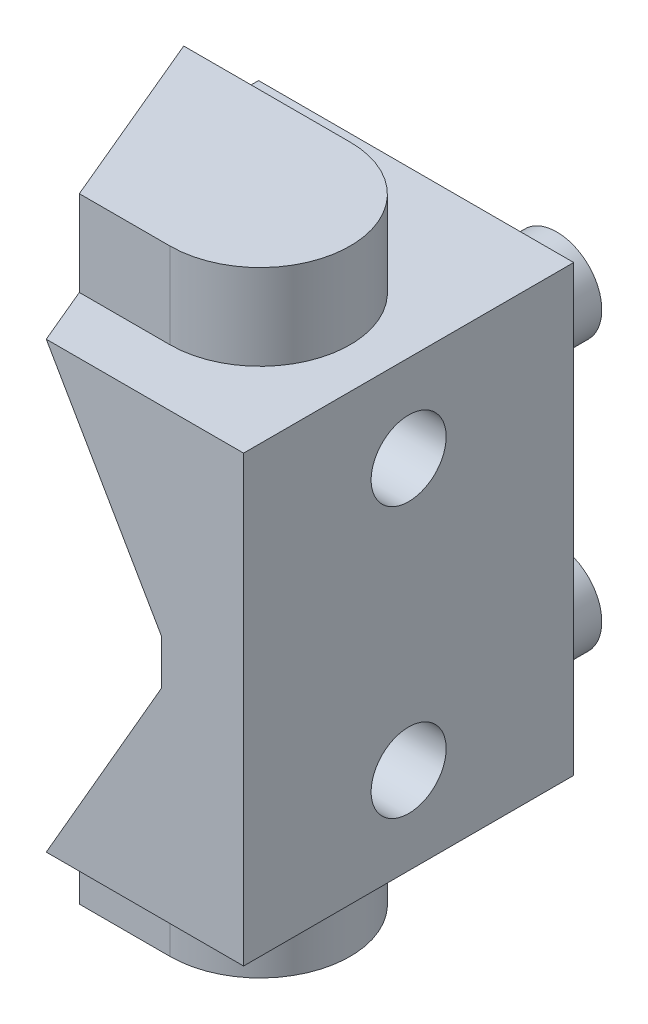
ISO-10303-21;
HEADER;
FILE_DESCRIPTION(('STEP AP214'),'2;1');
FILE_NAME('part.step','',(''),(''),'','','');
FILE_SCHEMA(('AUTOMOTIVE_DESIGN { 1 0 10303 214 1 1 1 1 }'));
ENDSEC;
DATA;
#1=APPLICATION_CONTEXT('core data for automotive mechanical design processes');
#2=APPLICATION_PROTOCOL_DEFINITION('international standard','automotive_design',2000,#1);
#3=PRODUCT_CONTEXT('',#1,'mechanical');
#4=PRODUCT('Part','Part','',(#3));
#5=PRODUCT_RELATED_PRODUCT_CATEGORY('part','',(#4));
#6=PRODUCT_DEFINITION_FORMATION('','',#4);
#7=PRODUCT_DEFINITION_CONTEXT('part definition',#1,'design');
#8=PRODUCT_DEFINITION('design','',#6,#7);
#9=PRODUCT_DEFINITION_SHAPE('','',#8);
#10=(LENGTH_UNIT() NAMED_UNIT(*) SI_UNIT(.MILLI.,.METRE.));
#11=(NAMED_UNIT(*) PLANE_ANGLE_UNIT() SI_UNIT($,.RADIAN.));
#12=(NAMED_UNIT(*) SI_UNIT($,.STERADIAN.) SOLID_ANGLE_UNIT());
#13=UNCERTAINTY_MEASURE_WITH_UNIT(LENGTH_MEASURE(1.E-05),#10,'distance_accuracy_value','');
#14=(GEOMETRIC_REPRESENTATION_CONTEXT(3) GLOBAL_UNCERTAINTY_ASSIGNED_CONTEXT((#13)) GLOBAL_UNIT_ASSIGNED_CONTEXT((#10,
#11,#12)) REPRESENTATION_CONTEXT('',''));
#15=CARTESIAN_POINT('',(0.,0.,0.));
#16=DIRECTION('',(0.,0.,1.));
#17=DIRECTION('',(1.,0.,0.));
#18=AXIS2_PLACEMENT_3D('',#15,#16,#17);
#19=CARTESIAN_POINT('',(-10.7228679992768,0.,0.));
#20=DIRECTION('',(0.,0.,-1.));
#21=DIRECTION('',(-1.,0.,0.));
#22=AXIS2_PLACEMENT_3D('',#19,#20,#21);
#23=PLANE('',#22);
#24=CARTESIAN_POINT('',(-5.12842325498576,9.,0.));
#25=DIRECTION('',(0.,0.,-1.));
#26=DIRECTION('',(-1.,0.,0.));
#27=AXIS2_PLACEMENT_3D('',#24,#25,#26);
#28=CIRCLE('',#27,3.);
#29=CARTESIAN_POINT('',(-8.12842325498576,9.,0.));
#30=VERTEX_POINT('',#29);
#31=EDGE_CURVE('E407',#30,#30,#28,.T.);
#32=ORIENTED_EDGE('',*,*,#31,.F.);
#33=EDGE_LOOP('',(#32));
#34=FACE_BOUND('',#33,.T.);
#35=DIRECTION('',(0.,-1.,0.));
#36=VECTOR('',#35,1.);
#37=CARTESIAN_POINT('',(0.,-14.8,0.));
#38=LINE('',#37,#36);
#39=CARTESIAN_POINT('',(0.,14.8,0.));
#40=VERTEX_POINT('',#39);
#41=CARTESIAN_POINT('',(0.,-14.8,0.));
#42=VERTEX_POINT('',#41);
#43=EDGE_CURVE('E129',#40,#42,#38,.T.);
#44=ORIENTED_EDGE('',*,*,#43,.T.);
#45=DIRECTION('',(-1.,0.,0.));
#46=VECTOR('',#45,1.);
#47=CARTESIAN_POINT('',(-10.7228679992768,-14.8,0.));
#48=LINE('',#47,#46);
#49=CARTESIAN_POINT('',(-21.,-14.8,0.));
#50=VERTEX_POINT('',#49);
#51=EDGE_CURVE('E138',#42,#50,#48,.T.);
#52=ORIENTED_EDGE('',*,*,#51,.T.);
#53=DIRECTION('',(0.,1.,0.));
#54=VECTOR('',#53,1.);
#55=CARTESIAN_POINT('',(-21.,0.,0.));
#56=LINE('',#55,#54);
#57=CARTESIAN_POINT('',(-21.,-12.3843031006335,0.));
#58=VERTEX_POINT('',#57);
#59=EDGE_CURVE('E148',#50,#58,#56,.T.);
#60=ORIENTED_EDGE('',*,*,#59,.T.);
#61=DIRECTION('',(0.5,0.866025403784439,0.));
#62=VECTOR('',#61,1.);
#63=CARTESIAN_POINT('',(-21.,-12.3843031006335,0.));
#64=LINE('',#63,#62);
#65=CARTESIAN_POINT('',(-14.7159277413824,-1.49997067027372,0.));
#66=VERTEX_POINT('',#65);
#67=EDGE_CURVE('E151',#58,#66,#64,.T.);
#68=ORIENTED_EDGE('',*,*,#67,.T.);
#69=DIRECTION('',(0.,1.,0.));
#70=VECTOR('',#69,1.);
#71=CARTESIAN_POINT('',(-14.7159277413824,0.,0.));
#72=LINE('',#71,#70);
#73=CARTESIAN_POINT('',(-14.7159277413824,1.49997067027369,0.));
#74=VERTEX_POINT('',#73);
#75=EDGE_CURVE('E202',#66,#74,#72,.T.);
#76=ORIENTED_EDGE('',*,*,#75,.T.);
#77=DIRECTION('',(-0.5,0.866025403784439,0.));
#78=VECTOR('',#77,1.);
#79=CARTESIAN_POINT('',(-14.7159277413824,1.49997067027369,0.));
#80=LINE('',#79,#78);
#81=CARTESIAN_POINT('',(-21.,12.3843031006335,0.));
#82=VERTEX_POINT('',#81);
#83=EDGE_CURVE('E199',#74,#82,#80,.T.);
#84=ORIENTED_EDGE('',*,*,#83,.T.);
#85=DIRECTION('',(0.,1.,0.));
#86=VECTOR('',#85,1.);
#87=CARTESIAN_POINT('',(-21.,0.,0.));
#88=LINE('',#87,#86);
#89=CARTESIAN_POINT('',(-21.,14.8,0.));
#90=VERTEX_POINT('',#89);
#91=EDGE_CURVE('E23',#82,#90,#88,.T.);
#92=ORIENTED_EDGE('',*,*,#91,.T.);
#93=DIRECTION('',(-1.,0.,0.));
#94=VECTOR('',#93,1.);
#95=CARTESIAN_POINT('',(-10.7228679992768,14.8,0.));
#96=LINE('',#95,#94);
#97=EDGE_CURVE('E9',#90,#40,#96,.F.);
#98=ORIENTED_EDGE('',*,*,#97,.T.);
#99=EDGE_LOOP('',(#44,#52,#60,#68,#76,#84,#92,#98));
#100=FACE_BOUND('',#99,.T.);
#101=CARTESIAN_POINT('',(-5.12842325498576,-9.,0.));
#102=DIRECTION('',(0.,0.,-1.));
#103=DIRECTION('',(-1.,0.,0.));
#104=AXIS2_PLACEMENT_3D('',#101,#102,#103);
#105=CIRCLE('',#104,3.);
#106=CARTESIAN_POINT('',(-8.12842325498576,-9.,0.));
#107=VERTEX_POINT('',#106);
#108=EDGE_CURVE('E408',#107,#107,#105,.T.);
#109=ORIENTED_EDGE('',*,*,#108,.F.);
#110=EDGE_LOOP('',(#109));
#111=FACE_BOUND('',#110,.T.);
#112=ADVANCED_FACE('F14',(#34,#100,#111),#23,.T.);
#113=CARTESIAN_POINT('',(-9.3545990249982,20.5,12.2));
#114=DIRECTION('',(0.,1.,0.));
#115=DIRECTION('',(1.,0.,0.));
#116=AXIS2_PLACEMENT_3D('',#113,#114,#115);
#117=PLANE('',#116);
#118=CARTESIAN_POINT('',(-8.7,20.5,12.2));
#119=DIRECTION('',(0.,1.,0.));
#120=DIRECTION('',(1.,0.,0.));
#121=AXIS2_PLACEMENT_3D('',#118,#119,#120);
#122=CIRCLE('',#121,6.);
#123=CARTESIAN_POINT('',(-8.7,20.5,18.2));
#124=VERTEX_POINT('',#123);
#125=CARTESIAN_POINT('',(-8.7,20.5,6.2));
#126=VERTEX_POINT('',#125);
#127=EDGE_CURVE('E224',#124,#126,#122,.T.);
#128=ORIENTED_EDGE('',*,*,#127,.T.);
#129=DIRECTION('',(-1.,0.,0.));
#130=VECTOR('',#129,1.);
#131=CARTESIAN_POINT('',(-8.7,20.5,6.2));
#132=LINE('',#131,#130);
#133=CARTESIAN_POINT('',(-19.7889881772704,20.5,6.2));
#134=VERTEX_POINT('',#133);
#135=EDGE_CURVE('E227',#126,#134,#132,.T.);
#136=ORIENTED_EDGE('',*,*,#135,.T.);
#137=DIRECTION('',(0.387449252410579,0.,0.921891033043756));
#138=VECTOR('',#137,1.);
#139=CARTESIAN_POINT('',(-19.7889881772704,20.5,6.2));
#140=LINE('',#139,#138);
#141=CARTESIAN_POINT('',(-14.7456686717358,20.5,18.2));
#142=VERTEX_POINT('',#141);
#143=EDGE_CURVE('E241',#134,#142,#140,.T.);
#144=ORIENTED_EDGE('',*,*,#143,.T.);
#145=DIRECTION('',(1.,0.,0.));
#146=VECTOR('',#145,1.);
#147=CARTESIAN_POINT('',(-8.7,20.5,18.2));
#148=LINE('',#147,#146);
#149=EDGE_CURVE('E244',#142,#124,#148,.T.);
#150=ORIENTED_EDGE('',*,*,#149,.T.);
#151=EDGE_LOOP('',(#128,#136,#144,#150));
#152=FACE_BOUND('',#151,.T.);
#153=ADVANCED_FACE('F303',(#152),#117,.T.);
#154=CARTESIAN_POINT('',(-19.7889881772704,-6.08141558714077,6.2));
#155=DIRECTION('',(-0.921891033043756,0.,0.387449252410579));
#156=DIRECTION('',(0.387449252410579,0.,0.921891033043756));
#157=AXIS2_PLACEMENT_3D('',#154,#155,#156);
#158=PLANE('',#157);
#159=DIRECTION('',(-0.387449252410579,0.,-0.921891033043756));
#160=VECTOR('',#159,1.);
#161=CARTESIAN_POINT('',(-19.7889881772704,14.8,6.2));
#162=LINE('',#161,#160);
#163=CARTESIAN_POINT('',(-14.7456686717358,14.8,18.2));
#164=VERTEX_POINT('',#163);
#165=CARTESIAN_POINT('',(-19.7889881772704,14.8,6.2));
#166=VERTEX_POINT('',#165);
#167=EDGE_CURVE('E231',#164,#166,#162,.T.);
#168=ORIENTED_EDGE('',*,*,#167,.F.);
#169=DIRECTION('',(0.,1.,0.));
#170=VECTOR('',#169,1.);
#171=CARTESIAN_POINT('',(-14.7456686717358,-6.08141558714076,18.2));
#172=LINE('',#171,#170);
#173=EDGE_CURVE('E249',#164,#142,#172,.T.);
#174=ORIENTED_EDGE('',*,*,#173,.T.);
#175=ORIENTED_EDGE('',*,*,#143,.F.);
#176=DIRECTION('',(0.,1.,0.));
#177=VECTOR('',#176,1.);
#178=CARTESIAN_POINT('',(-19.7889881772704,-6.08141558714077,6.2));
#179=LINE('',#178,#177);
#180=EDGE_CURVE('E251',#166,#134,#179,.T.);
#181=ORIENTED_EDGE('',*,*,#180,.F.);
#182=EDGE_LOOP('',(#168,#174,#175,#181));
#183=FACE_BOUND('',#182,.T.);
#184=ADVANCED_FACE('F294',(#183),#158,.T.);
#185=CARTESIAN_POINT('',(-19.7889881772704,6.08141558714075,6.2));
#186=DIRECTION('',(-0.921891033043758,0.,0.387449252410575));
#187=DIRECTION('',(0.387449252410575,0.,0.921891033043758));
#188=AXIS2_PLACEMENT_3D('',#185,#186,#187);
#189=PLANE('',#188);
#190=DIRECTION('',(0.387449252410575,0.,0.921891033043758));
#191=VECTOR('',#190,1.);
#192=CARTESIAN_POINT('',(-19.7889881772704,-14.8,6.2));
#193=LINE('',#192,#191);
#194=CARTESIAN_POINT('',(-19.7889881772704,-14.8,6.2));
#195=VERTEX_POINT('',#194);
#196=CARTESIAN_POINT('',(-14.7456686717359,-14.8,18.2));
#197=VERTEX_POINT('',#196);
#198=EDGE_CURVE('E256',#195,#197,#193,.T.);
#199=ORIENTED_EDGE('',*,*,#198,.F.);
#200=DIRECTION('',(0.,-1.,0.));
#201=VECTOR('',#200,1.);
#202=CARTESIAN_POINT('',(-19.7889881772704,6.08141558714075,6.2));
#203=LINE('',#202,#201);
#204=CARTESIAN_POINT('',(-19.7889881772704,-20.5,6.2));
#205=VERTEX_POINT('',#204);
#206=EDGE_CURVE('E274',#195,#205,#203,.T.);
#207=ORIENTED_EDGE('',*,*,#206,.T.);
#208=DIRECTION('',(-0.387449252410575,0.,-0.921891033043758));
#209=VECTOR('',#208,1.);
#210=CARTESIAN_POINT('',(-19.7889881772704,-20.5,6.2));
#211=LINE('',#210,#209);
#212=CARTESIAN_POINT('',(-14.7456686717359,-20.5,18.2));
#213=VERTEX_POINT('',#212);
#214=EDGE_CURVE('E267',#213,#205,#211,.T.);
#215=ORIENTED_EDGE('',*,*,#214,.F.);
#216=DIRECTION('',(0.,-1.,0.));
#217=VECTOR('',#216,1.);
#218=CARTESIAN_POINT('',(-14.7456686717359,6.08141558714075,18.2));
#219=LINE('',#218,#217);
#220=EDGE_CURVE('E275',#197,#213,#219,.T.);
#221=ORIENTED_EDGE('',*,*,#220,.F.);
#222=EDGE_LOOP('',(#199,#207,#215,#221));
#223=FACE_BOUND('',#222,.T.);
#224=ADVANCED_FACE('F292',(#223),#189,.T.);
#225=CARTESIAN_POINT('',(-9.3545990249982,-20.5,12.2));
#226=DIRECTION('',(0.,1.,0.));
#227=DIRECTION('',(1.,0.,0.));
#228=AXIS2_PLACEMENT_3D('',#225,#226,#227);
#229=PLANE('',#228);
#230=CARTESIAN_POINT('',(-8.7,-20.5,12.2));
#231=DIRECTION('',(0.,-1.,0.));
#232=DIRECTION('',(-1.,0.,0.));
#233=AXIS2_PLACEMENT_3D('',#230,#231,#232);
#234=CIRCLE('',#233,6.);
#235=CARTESIAN_POINT('',(-8.7,-20.5,6.2));
#236=VERTEX_POINT('',#235);
#237=CARTESIAN_POINT('',(-8.7,-20.5,18.2));
#238=VERTEX_POINT('',#237);
#239=EDGE_CURVE('E255',#236,#238,#234,.T.);
#240=ORIENTED_EDGE('',*,*,#239,.T.);
#241=DIRECTION('',(-1.,0.,0.));
#242=VECTOR('',#241,1.);
#243=CARTESIAN_POINT('',(-8.7,-20.5,18.2));
#244=LINE('',#243,#242);
#245=EDGE_CURVE('E264',#238,#213,#244,.T.);
#246=ORIENTED_EDGE('',*,*,#245,.T.);
#247=ORIENTED_EDGE('',*,*,#214,.T.);
#248=DIRECTION('',(1.,0.,0.));
#249=VECTOR('',#248,1.);
#250=CARTESIAN_POINT('',(-8.7,-20.5,6.2));
#251=LINE('',#250,#249);
#252=EDGE_CURVE('E270',#205,#236,#251,.T.);
#253=ORIENTED_EDGE('',*,*,#252,.T.);
#254=EDGE_LOOP('',(#240,#246,#247,#253));
#255=FACE_BOUND('',#254,.T.);
#256=ADVANCED_FACE('F16',(#255),#229,.F.);
#257=CARTESIAN_POINT('',(-8.7,-6.08141558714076,12.2));
#258=DIRECTION('',(0.,1.,0.));
#259=DIRECTION('',(1.,0.,0.));
#260=AXIS2_PLACEMENT_3D('',#257,#258,#259);
#261=CYLINDRICAL_SURFACE('',#260,6.);
#262=CARTESIAN_POINT('',(-8.7,14.8,12.2));
#263=DIRECTION('',(0.,1.,0.));
#264=DIRECTION('',(1.,0.,0.));
#265=AXIS2_PLACEMENT_3D('',#262,#263,#264);
#266=CIRCLE('',#265,6.);
#267=CARTESIAN_POINT('',(-8.7,14.8,6.2));
#268=VERTEX_POINT('',#267);
#269=CARTESIAN_POINT('',(-8.7,14.8,18.2));
#270=VERTEX_POINT('',#269);
#271=EDGE_CURVE('E39',#268,#270,#266,.F.);
#272=ORIENTED_EDGE('',*,*,#271,.F.);
#273=DIRECTION('',(0.,1.,0.));
#274=VECTOR('',#273,1.);
#275=CARTESIAN_POINT('',(-8.7,-6.08141558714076,6.2));
#276=LINE('',#275,#274);
#277=EDGE_CURVE('E247',#268,#126,#276,.T.);
#278=ORIENTED_EDGE('',*,*,#277,.T.);
#279=ORIENTED_EDGE('',*,*,#127,.F.);
#280=DIRECTION('',(0.,1.,0.));
#281=VECTOR('',#280,1.);
#282=CARTESIAN_POINT('',(-8.7,-6.08141558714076,18.2));
#283=LINE('',#282,#281);
#284=EDGE_CURVE('E235',#270,#124,#283,.T.);
#285=ORIENTED_EDGE('',*,*,#284,.F.);
#286=EDGE_LOOP('',(#272,#278,#279,#285));
#287=FACE_BOUND('',#286,.T.);
#288=ADVANCED_FACE('F302',(#287),#261,.T.);
#289=CARTESIAN_POINT('',(-8.7,-6.08141558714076,6.2));
#290=DIRECTION('',(0.,0.,-1.));
#291=DIRECTION('',(0.,-1.,0.));
#292=AXIS2_PLACEMENT_3D('',#289,#290,#291);
#293=PLANE('',#292);
#294=DIRECTION('',(1.,0.,0.));
#295=VECTOR('',#294,1.);
#296=CARTESIAN_POINT('',(-8.7,14.8,6.2));
#297=LINE('',#296,#295);
#298=EDGE_CURVE('E237',#166,#268,#297,.T.);
#299=ORIENTED_EDGE('',*,*,#298,.F.);
#300=ORIENTED_EDGE('',*,*,#180,.T.);
#301=ORIENTED_EDGE('',*,*,#135,.F.);
#302=ORIENTED_EDGE('',*,*,#277,.F.);
#303=EDGE_LOOP('',(#299,#300,#301,#302));
#304=FACE_BOUND('',#303,.T.);
#305=ADVANCED_FACE('F355',(#304),#293,.T.);
#306=CARTESIAN_POINT('',(-8.7,-6.08141558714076,18.2));
#307=DIRECTION('',(0.,0.,1.));
#308=DIRECTION('',(1.,0.,0.));
#309=AXIS2_PLACEMENT_3D('',#306,#307,#308);
#310=PLANE('',#309);
#311=DIRECTION('',(-1.,0.,0.));
#312=VECTOR('',#311,1.);
#313=CARTESIAN_POINT('',(-8.7,14.8,18.2));
#314=LINE('',#313,#312);
#315=EDGE_CURVE('E234',#270,#164,#314,.T.);
#316=ORIENTED_EDGE('',*,*,#315,.F.);
#317=ORIENTED_EDGE('',*,*,#284,.T.);
#318=ORIENTED_EDGE('',*,*,#149,.F.);
#319=ORIENTED_EDGE('',*,*,#173,.F.);
#320=EDGE_LOOP('',(#316,#317,#318,#319));
#321=FACE_BOUND('',#320,.T.);
#322=ADVANCED_FACE('F324',(#321),#310,.T.);
#323=CARTESIAN_POINT('',(-21.,0.,10.9));
#324=DIRECTION('',(-1.,0.,0.));
#325=DIRECTION('',(0.,1.,0.));
#326=AXIS2_PLACEMENT_3D('',#323,#324,#325);
#327=PLANE('',#326);
#328=DIRECTION('',(0.,0.588524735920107,0.808479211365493));
#329=VECTOR('',#328,1.);
#330=CARTESIAN_POINT('',(-21.,12.3843031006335,0.));
#331=LINE('',#330,#329);
#332=CARTESIAN_POINT('',(-21.,14.8,3.318536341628));
#333=VERTEX_POINT('',#332);
#334=EDGE_CURVE('E163',#82,#333,#331,.T.);
#335=ORIENTED_EDGE('',*,*,#334,.T.);
#336=DIRECTION('',(0.,0.,-1.));
#337=VECTOR('',#336,1.);
#338=CARTESIAN_POINT('',(-21.,14.8,-0.200000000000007));
#339=LINE('',#338,#337);
#340=EDGE_CURVE('E160',#90,#333,#339,.F.);
#341=ORIENTED_EDGE('',*,*,#340,.F.);
#342=ORIENTED_EDGE('',*,*,#91,.F.);
#343=EDGE_LOOP('',(#335,#341,#342));
#344=FACE_BOUND('',#343,.T.);
#345=ADVANCED_FACE('F220',(#344),#327,.T.);
#346=CARTESIAN_POINT('',(-15.6432315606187,11.0406591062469,10.9));
#347=DIRECTION('',(-0.813797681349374,-0.469846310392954,0.342020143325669));
#348=DIRECTION('',(-0.5,0.866025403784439,0.));
#349=AXIS2_PLACEMENT_3D('',#346,#347,#348);
#350=PLANE('',#349);
#351=DIRECTION('',(0.387449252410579,0.,0.921891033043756));
#352=VECTOR('',#351,1.);
#353=CARTESIAN_POINT('',(-21.,14.8,3.318536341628));
#354=LINE('',#353,#352);
#355=EDGE_CURVE('E154',#333,#166,#354,.T.);
#356=ORIENTED_EDGE('',*,*,#355,.F.);
#357=ORIENTED_EDGE('',*,*,#334,.F.);
#358=ORIENTED_EDGE('',*,*,#83,.F.);
#359=DIRECTION('',(0.387515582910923,-0.000135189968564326,0.921863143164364));
#360=VECTOR('',#359,1.);
#361=CARTESIAN_POINT('',(-14.7159277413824,1.49997067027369,0.));
#362=LINE('',#361,#360);
#363=CARTESIAN_POINT('',(-5.4679792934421,1.49674440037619,22.));
#364=VERTEX_POINT('',#363);
#365=EDGE_CURVE('E168',#74,#364,#362,.T.);
#366=ORIENTED_EDGE('',*,*,#365,.T.);
#367=DIRECTION('',(-0.5,0.866025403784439,0.));
#368=VECTOR('',#367,1.);
#369=CARTESIAN_POINT('',(-12.1444286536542,13.0606939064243,22.));
#370=LINE('',#369,#368);
#371=CARTESIAN_POINT('',(-13.1486174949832,14.8,22.));
#372=VERTEX_POINT('',#371);
#373=EDGE_CURVE('E165',#364,#372,#370,.T.);
#374=ORIENTED_EDGE('',*,*,#373,.T.);
#375=EDGE_CURVE('E159',#164,#372,#354,.T.);
#376=ORIENTED_EDGE('',*,*,#375,.F.);
#377=ORIENTED_EDGE('',*,*,#167,.T.);
#378=EDGE_LOOP('',(#356,#357,#358,#366,#374,#376,#377));
#379=FACE_BOUND('',#378,.T.);
#380=ADVANCED_FACE('F217',(#379),#350,.T.);
#381=CARTESIAN_POINT('',(-10.133989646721,8.15,10.9));
#382=DIRECTION('',(-0.921863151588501,0.,0.387515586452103));
#383=DIRECTION('',(0.387515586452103,0.,0.921863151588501));
#384=AXIS2_PLACEMENT_3D('',#381,#382,#383);
#385=PLANE('',#384);
#386=DIRECTION('',(0.,1.,0.));
#387=VECTOR('',#386,1.);
#388=CARTESIAN_POINT('',(-5.4679792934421,8.15,22.));
#389=LINE('',#388,#387);
#390=CARTESIAN_POINT('',(-5.467979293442,-1.49674440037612,22.));
#391=VERTEX_POINT('',#390);
#392=EDGE_CURVE('E171',#391,#364,#389,.T.);
#393=ORIENTED_EDGE('',*,*,#392,.T.);
#394=ORIENTED_EDGE('',*,*,#365,.F.);
#395=ORIENTED_EDGE('',*,*,#75,.F.);
#396=DIRECTION('',(0.387515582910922,0.000135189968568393,0.921863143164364));
#397=VECTOR('',#396,1.);
#398=CARTESIAN_POINT('',(-14.7159277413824,-1.49997067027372,0.));
#399=LINE('',#398,#397);
#400=EDGE_CURVE('E173',#66,#391,#399,.T.);
#401=ORIENTED_EDGE('',*,*,#400,.T.);
#402=EDGE_LOOP('',(#393,#394,#395,#401));
#403=FACE_BOUND('',#402,.T.);
#404=ADVANCED_FACE('F212',(#403),#385,.T.);
#405=CARTESIAN_POINT('',(-8.7,6.08141558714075,12.2));
#406=DIRECTION('',(0.,-1.,0.));
#407=DIRECTION('',(-1.,0.,0.));
#408=AXIS2_PLACEMENT_3D('',#405,#406,#407);
#409=CYLINDRICAL_SURFACE('',#408,6.);
#410=CARTESIAN_POINT('',(-8.7,-14.8,12.2));
#411=DIRECTION('',(0.,-1.,0.));
#412=DIRECTION('',(-1.,0.,0.));
#413=AXIS2_PLACEMENT_3D('',#410,#411,#412);
#414=CIRCLE('',#413,6.);
#415=CARTESIAN_POINT('',(-8.7,-14.8,18.2));
#416=VERTEX_POINT('',#415);
#417=CARTESIAN_POINT('',(-8.7,-14.8,6.2));
#418=VERTEX_POINT('',#417);
#419=EDGE_CURVE('E189',#416,#418,#414,.F.);
#420=ORIENTED_EDGE('',*,*,#419,.F.);
#421=DIRECTION('',(0.,-1.,0.));
#422=VECTOR('',#421,1.);
#423=CARTESIAN_POINT('',(-8.7,6.08141558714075,18.2));
#424=LINE('',#423,#422);
#425=EDGE_CURVE('E195',#416,#238,#424,.T.);
#426=ORIENTED_EDGE('',*,*,#425,.T.);
#427=ORIENTED_EDGE('',*,*,#239,.F.);
#428=DIRECTION('',(0.,-1.,0.));
#429=VECTOR('',#428,1.);
#430=CARTESIAN_POINT('',(-8.7,6.08141558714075,6.2));
#431=LINE('',#430,#429);
#432=EDGE_CURVE('E259',#418,#236,#431,.T.);
#433=ORIENTED_EDGE('',*,*,#432,.F.);
#434=EDGE_LOOP('',(#420,#426,#427,#433));
#435=FACE_BOUND('',#434,.T.);
#436=ADVANCED_FACE('F283',(#435),#409,.T.);
#437=CARTESIAN_POINT('',(-8.7,6.08141558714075,18.2));
#438=DIRECTION('',(0.,0.,1.));
#439=DIRECTION('',(1.,0.,0.));
#440=AXIS2_PLACEMENT_3D('',#437,#438,#439);
#441=PLANE('',#440);
#442=DIRECTION('',(1.,0.,0.));
#443=VECTOR('',#442,1.);
#444=CARTESIAN_POINT('',(-8.7,-14.8,18.2));
#445=LINE('',#444,#443);
#446=EDGE_CURVE('E185',#197,#416,#445,.T.);
#447=ORIENTED_EDGE('',*,*,#446,.F.);
#448=ORIENTED_EDGE('',*,*,#220,.T.);
#449=ORIENTED_EDGE('',*,*,#245,.F.);
#450=ORIENTED_EDGE('',*,*,#425,.F.);
#451=EDGE_LOOP('',(#447,#448,#449,#450));
#452=FACE_BOUND('',#451,.T.);
#453=ADVANCED_FACE('F285',(#452),#441,.T.);
#454=CARTESIAN_POINT('',(-21.,0.,10.9));
#455=DIRECTION('',(-1.,0.,0.));
#456=DIRECTION('',(0.,1.,0.));
#457=AXIS2_PLACEMENT_3D('',#454,#455,#456);
#458=PLANE('',#457);
#459=DIRECTION('',(0.,0.,-1.));
#460=VECTOR('',#459,1.);
#461=CARTESIAN_POINT('',(-21.,-14.8,10.9));
#462=LINE('',#461,#460);
#463=CARTESIAN_POINT('',(-21.,-14.8,3.318536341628));
#464=VERTEX_POINT('',#463);
#465=EDGE_CURVE('E146',#50,#464,#462,.F.);
#466=ORIENTED_EDGE('',*,*,#465,.T.);
#467=DIRECTION('',(0.,-0.588524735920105,0.808479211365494));
#468=VECTOR('',#467,1.);
#469=CARTESIAN_POINT('',(-21.,-12.3843031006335,0.));
#470=LINE('',#469,#468);
#471=EDGE_CURVE('E182',#58,#464,#470,.T.);
#472=ORIENTED_EDGE('',*,*,#471,.F.);
#473=ORIENTED_EDGE('',*,*,#59,.F.);
#474=EDGE_LOOP('',(#466,#472,#473));
#475=FACE_BOUND('',#474,.T.);
#476=ADVANCED_FACE('F331',(#475),#458,.T.);
#477=CARTESIAN_POINT('',(-6.13464357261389,5.42869839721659,10.9));
#478=DIRECTION('',(-0.813797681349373,0.469846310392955,0.342020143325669));
#479=DIRECTION('',(0.5,0.866025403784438,0.));
#480=AXIS2_PLACEMENT_3D('',#477,#478,#479);
#481=PLANE('',#480);
#482=DIRECTION('',(0.5,0.866025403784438,0.));
#483=VECTOR('',#482,1.);
#484=CARTESIAN_POINT('',(-2.63584066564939,3.40866359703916,22.));
#485=LINE('',#484,#483);
#486=CARTESIAN_POINT('',(-13.1486174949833,-14.8,22.));
#487=VERTEX_POINT('',#486);
#488=EDGE_CURVE('E176',#487,#391,#485,.T.);
#489=ORIENTED_EDGE('',*,*,#488,.T.);
#490=ORIENTED_EDGE('',*,*,#400,.F.);
#491=ORIENTED_EDGE('',*,*,#67,.F.);
#492=ORIENTED_EDGE('',*,*,#471,.T.);
#493=DIRECTION('',(0.387449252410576,0.,0.921891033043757));
#494=VECTOR('',#493,1.);
#495=CARTESIAN_POINT('',(-21.,-14.8,3.318536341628));
#496=LINE('',#495,#494);
#497=EDGE_CURVE('E178',#464,#195,#496,.T.);
#498=ORIENTED_EDGE('',*,*,#497,.T.);
#499=ORIENTED_EDGE('',*,*,#198,.T.);
#500=EDGE_CURVE('E181',#197,#487,#496,.T.);
#501=ORIENTED_EDGE('',*,*,#500,.T.);
#502=EDGE_LOOP('',(#489,#490,#491,#492,#498,#499,#501));
#503=FACE_BOUND('',#502,.T.);
#504=ADVANCED_FACE('F208',(#503),#481,.T.);
#505=CARTESIAN_POINT('',(-8.7,6.08141558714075,6.2));
#506=DIRECTION('',(0.,0.,-1.));
#507=DIRECTION('',(0.,-1.,0.));
#508=AXIS2_PLACEMENT_3D('',#505,#506,#507);
#509=PLANE('',#508);
#510=DIRECTION('',(-1.,0.,0.));
#511=VECTOR('',#510,1.);
#512=CARTESIAN_POINT('',(-8.7,-14.8,6.2));
#513=LINE('',#512,#511);
#514=EDGE_CURVE('E192',#418,#195,#513,.T.);
#515=ORIENTED_EDGE('',*,*,#514,.F.);
#516=ORIENTED_EDGE('',*,*,#432,.T.);
#517=ORIENTED_EDGE('',*,*,#252,.F.);
#518=ORIENTED_EDGE('',*,*,#206,.F.);
#519=EDGE_LOOP('',(#515,#516,#517,#518));
#520=FACE_BOUND('',#519,.T.);
#521=ADVANCED_FACE('F290',(#520),#509,.T.);
#522=CARTESIAN_POINT('',(-1.7,14.8,22.));
#523=DIRECTION('',(0.,0.,1.));
#524=DIRECTION('',(1.,0.,0.));
#525=AXIS2_PLACEMENT_3D('',#522,#523,#524);
#526=PLANE('',#525);
#527=DIRECTION('',(0.,1.,0.));
#528=VECTOR('',#527,1.);
#529=CARTESIAN_POINT('',(0.,14.8,22.));
#530=LINE('',#529,#528);
#531=CARTESIAN_POINT('',(0.,-14.8,22.));
#532=VERTEX_POINT('',#531);
#533=CARTESIAN_POINT('',(0.,14.8,22.));
#534=VERTEX_POINT('',#533);
#535=EDGE_CURVE('E31',#532,#534,#530,.T.);
#536=ORIENTED_EDGE('',*,*,#535,.T.);
#537=DIRECTION('',(1.,0.,0.));
#538=VECTOR('',#537,1.);
#539=CARTESIAN_POINT('',(-1.7,14.8,22.));
#540=LINE('',#539,#538);
#541=EDGE_CURVE('E149',#372,#534,#540,.T.);
#542=ORIENTED_EDGE('',*,*,#541,.F.);
#543=ORIENTED_EDGE('',*,*,#373,.F.);
#544=ORIENTED_EDGE('',*,*,#392,.F.);
#545=ORIENTED_EDGE('',*,*,#488,.F.);
#546=DIRECTION('',(-1.,0.,0.));
#547=VECTOR('',#546,1.);
#548=CARTESIAN_POINT('',(-1.7,-14.8,22.));
#549=LINE('',#548,#547);
#550=EDGE_CURVE('E18',#532,#487,#549,.T.);
#551=ORIENTED_EDGE('',*,*,#550,.F.);
#552=EDGE_LOOP('',(#536,#542,#543,#544,#545,#551));
#553=FACE_BOUND('',#552,.T.);
#554=ADVANCED_FACE('F321',(#553),#526,.T.);
#555=CARTESIAN_POINT('',(-1.7,14.8,-0.200000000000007));
#556=DIRECTION('',(0.,1.,0.));
#557=DIRECTION('',(1.,0.,0.));
#558=AXIS2_PLACEMENT_3D('',#555,#556,#557);
#559=PLANE('',#558);
#560=DIRECTION('',(0.,0.,-1.));
#561=VECTOR('',#560,1.);
#562=CARTESIAN_POINT('',(0.,14.8,22.));
#563=LINE('',#562,#561);
#564=EDGE_CURVE('E222',#534,#40,#563,.T.);
#565=ORIENTED_EDGE('',*,*,#564,.T.);
#566=ORIENTED_EDGE('',*,*,#97,.F.);
#567=ORIENTED_EDGE('',*,*,#340,.T.);
#568=ORIENTED_EDGE('',*,*,#355,.T.);
#569=ORIENTED_EDGE('',*,*,#298,.T.);
#570=ORIENTED_EDGE('',*,*,#271,.T.);
#571=ORIENTED_EDGE('',*,*,#315,.T.);
#572=ORIENTED_EDGE('',*,*,#375,.T.);
#573=ORIENTED_EDGE('',*,*,#541,.T.);
#574=EDGE_LOOP('',(#565,#566,#567,#568,#569,#570,#571,#572,#573));
#575=FACE_BOUND('',#574,.T.);
#576=ADVANCED_FACE('F221',(#575),#559,.T.);
#577=CARTESIAN_POINT('',(-1.7,-14.8,22.));
#578=DIRECTION('',(0.,-1.,0.));
#579=DIRECTION('',(-1.,0.,0.));
#580=AXIS2_PLACEMENT_3D('',#577,#578,#579);
#581=PLANE('',#580);
#582=DIRECTION('',(0.,0.,1.));
#583=VECTOR('',#582,1.);
#584=CARTESIAN_POINT('',(0.,-14.8,0.));
#585=LINE('',#584,#583);
#586=EDGE_CURVE('E126',#42,#532,#585,.T.);
#587=ORIENTED_EDGE('',*,*,#586,.T.);
#588=ORIENTED_EDGE('',*,*,#550,.T.);
#589=ORIENTED_EDGE('',*,*,#500,.F.);
#590=ORIENTED_EDGE('',*,*,#446,.T.);
#591=ORIENTED_EDGE('',*,*,#419,.T.);
#592=ORIENTED_EDGE('',*,*,#514,.T.);
#593=ORIENTED_EDGE('',*,*,#497,.F.);
#594=ORIENTED_EDGE('',*,*,#465,.F.);
#595=ORIENTED_EDGE('',*,*,#51,.F.);
#596=EDGE_LOOP('',(#587,#588,#589,#590,#591,#592,#593,#594,#595));
#597=FACE_BOUND('',#596,.T.);
#598=ADVANCED_FACE('F144',(#597),#581,.T.);
#599=CARTESIAN_POINT('',(0.,0.,0.));
#600=DIRECTION('',(-1.,0.,0.));
#601=DIRECTION('',(0.,0.,1.));
#602=AXIS2_PLACEMENT_3D('',#599,#600,#601);
#603=PLANE('',#602);
#604=CARTESIAN_POINT('',(0.,9.,11.));
#605=DIRECTION('',(1.,0.,0.));
#606=DIRECTION('',(0.,0.,-1.));
#607=AXIS2_PLACEMENT_3D('',#604,#605,#606);
#608=CIRCLE('',#607,2.5);
#609=CARTESIAN_POINT('',(0.,9.,8.5));
#610=VERTEX_POINT('',#609);
#611=EDGE_CURVE('E417',#610,#610,#608,.T.);
#612=ORIENTED_EDGE('',*,*,#611,.F.);
#613=EDGE_LOOP('',(#612));
#614=FACE_BOUND('',#613,.T.);
#615=CARTESIAN_POINT('',(0.,-9.,11.));
#616=DIRECTION('',(1.,0.,0.));
#617=DIRECTION('',(0.,0.,-1.));
#618=AXIS2_PLACEMENT_3D('',#615,#616,#617);
#619=CIRCLE('',#618,2.5);
#620=CARTESIAN_POINT('',(0.,-9.,8.5));
#621=VERTEX_POINT('',#620);
#622=EDGE_CURVE('E422',#621,#621,#619,.T.);
#623=ORIENTED_EDGE('',*,*,#622,.F.);
#624=EDGE_LOOP('',(#623));
#625=FACE_BOUND('',#624,.T.);
#626=ORIENTED_EDGE('',*,*,#43,.F.);
#627=ORIENTED_EDGE('',*,*,#564,.F.);
#628=ORIENTED_EDGE('',*,*,#535,.F.);
#629=ORIENTED_EDGE('',*,*,#586,.F.);
#630=EDGE_LOOP('',(#626,#627,#628,#629));
#631=FACE_BOUND('',#630,.T.);
#632=ADVANCED_FACE('F128',(#614,#625,#631),#603,.F.);
#633=CARTESIAN_POINT('',(-10.,-9.,11.));
#634=DIRECTION('',(1.,0.,0.));
#635=DIRECTION('',(0.,0.,-1.));
#636=AXIS2_PLACEMENT_3D('',#633,#634,#635);
#637=CYLINDRICAL_SURFACE('',#636,2.5);
#638=CARTESIAN_POINT('',(-10.,-9.,11.));
#639=DIRECTION('',(1.,0.,0.));
#640=DIRECTION('',(0.,0.,-1.));
#641=AXIS2_PLACEMENT_3D('',#638,#639,#640);
#642=CIRCLE('',#641,2.5);
#643=CARTESIAN_POINT('',(-10.,-9.,8.5));
#644=VERTEX_POINT('',#643);
#645=EDGE_CURVE('E142',#644,#644,#642,.T.);
#646=ORIENTED_EDGE('',*,*,#645,.F.);
#647=EDGE_LOOP('',(#646));
#648=FACE_BOUND('',#647,.T.);
#649=ORIENTED_EDGE('',*,*,#622,.T.);
#650=EDGE_LOOP('',(#649));
#651=FACE_BOUND('',#650,.T.);
#652=ADVANCED_FACE('F369',(#648,#651),#637,.F.);
#653=CARTESIAN_POINT('',(-10.,-9.,11.));
#654=DIRECTION('',(1.,0.,0.));
#655=DIRECTION('',(0.,0.,-1.));
#656=AXIS2_PLACEMENT_3D('',#653,#654,#655);
#657=PLANE('',#656);
#658=ORIENTED_EDGE('',*,*,#645,.T.);
#659=EDGE_LOOP('',(#658));
#660=FACE_BOUND('',#659,.T.);
#661=ADVANCED_FACE('F373',(#660),#657,.T.);
#662=CARTESIAN_POINT('',(-10.,9.,11.));
#663=DIRECTION('',(1.,0.,0.));
#664=DIRECTION('',(0.,0.,-1.));
#665=AXIS2_PLACEMENT_3D('',#662,#663,#664);
#666=CYLINDRICAL_SURFACE('',#665,2.5);
#667=CARTESIAN_POINT('',(-10.,9.,11.));
#668=DIRECTION('',(1.,0.,0.));
#669=DIRECTION('',(0.,0.,-1.));
#670=AXIS2_PLACEMENT_3D('',#667,#668,#669);
#671=CIRCLE('',#670,2.5);
#672=CARTESIAN_POINT('',(-10.,9.,8.5));
#673=VERTEX_POINT('',#672);
#674=EDGE_CURVE('E419',#673,#673,#671,.T.);
#675=ORIENTED_EDGE('',*,*,#674,.F.);
#676=EDGE_LOOP('',(#675));
#677=FACE_BOUND('',#676,.T.);
#678=ORIENTED_EDGE('',*,*,#611,.T.);
#679=EDGE_LOOP('',(#678));
#680=FACE_BOUND('',#679,.T.);
#681=ADVANCED_FACE('F377',(#677,#680),#666,.F.);
#682=CARTESIAN_POINT('',(-10.,9.,11.));
#683=DIRECTION('',(1.,0.,0.));
#684=DIRECTION('',(0.,0.,-1.));
#685=AXIS2_PLACEMENT_3D('',#682,#683,#684);
#686=PLANE('',#685);
#687=ORIENTED_EDGE('',*,*,#674,.T.);
#688=EDGE_LOOP('',(#687));
#689=FACE_BOUND('',#688,.T.);
#690=ADVANCED_FACE('F381',(#689),#686,.T.);
#691=CARTESIAN_POINT('',(-5.12842325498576,9.,-4.));
#692=DIRECTION('',(0.,0.,1.));
#693=DIRECTION('',(1.,0.,0.));
#694=AXIS2_PLACEMENT_3D('',#691,#692,#693);
#695=CYLINDRICAL_SURFACE('',#694,3.);
#696=CARTESIAN_POINT('',(-5.12842325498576,9.,-4.));
#697=DIRECTION('',(0.,0.,-1.));
#698=DIRECTION('',(-1.,0.,0.));
#699=AXIS2_PLACEMENT_3D('',#696,#697,#698);
#700=CIRCLE('',#699,3.);
#701=CARTESIAN_POINT('',(-8.12842325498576,9.,-4.));
#702=VERTEX_POINT('',#701);
#703=EDGE_CURVE('E411',#702,#702,#700,.T.);
#704=ORIENTED_EDGE('',*,*,#703,.F.);
#705=EDGE_LOOP('',(#704));
#706=FACE_BOUND('',#705,.T.);
#707=ORIENTED_EDGE('',*,*,#31,.T.);
#708=EDGE_LOOP('',(#707));
#709=FACE_BOUND('',#708,.T.);
#710=ADVANCED_FACE('F385',(#706,#709),#695,.T.);
#711=CARTESIAN_POINT('',(-5.12842325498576,9.,-4.));
#712=DIRECTION('',(0.,0.,-1.));
#713=DIRECTION('',(-1.,0.,0.));
#714=AXIS2_PLACEMENT_3D('',#711,#712,#713);
#715=PLANE('',#714);
#716=ORIENTED_EDGE('',*,*,#703,.T.);
#717=EDGE_LOOP('',(#716));
#718=FACE_BOUND('',#717,.T.);
#719=ADVANCED_FACE('F389',(#718),#715,.T.);
#720=CARTESIAN_POINT('',(-5.12842325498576,-9.,-4.));
#721=DIRECTION('',(0.,0.,1.));
#722=DIRECTION('',(1.,0.,0.));
#723=AXIS2_PLACEMENT_3D('',#720,#721,#722);
#724=CYLINDRICAL_SURFACE('',#723,3.);
#725=CARTESIAN_POINT('',(-5.12842325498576,-9.,-4.));
#726=DIRECTION('',(0.,0.,-1.));
#727=DIRECTION('',(-1.,0.,0.));
#728=AXIS2_PLACEMENT_3D('',#725,#726,#727);
#729=CIRCLE('',#728,3.);
#730=CARTESIAN_POINT('',(-8.12842325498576,-9.,-4.));
#731=VERTEX_POINT('',#730);
#732=EDGE_CURVE('E406',#731,#731,#729,.T.);
#733=ORIENTED_EDGE('',*,*,#732,.F.);
#734=EDGE_LOOP('',(#733));
#735=FACE_BOUND('',#734,.T.);
#736=ORIENTED_EDGE('',*,*,#108,.T.);
#737=EDGE_LOOP('',(#736));
#738=FACE_BOUND('',#737,.T.);
#739=ADVANCED_FACE('F393',(#735,#738),#724,.T.);
#740=CARTESIAN_POINT('',(-5.12842325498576,-9.,-4.));
#741=DIRECTION('',(0.,0.,-1.));
#742=DIRECTION('',(-1.,0.,0.));
#743=AXIS2_PLACEMENT_3D('',#740,#741,#742);
#744=PLANE('',#743);
#745=ORIENTED_EDGE('',*,*,#732,.T.);
#746=EDGE_LOOP('',(#745));
#747=FACE_BOUND('',#746,.T.);
#748=ADVANCED_FACE('F397',(#747),#744,.T.);
#749=CLOSED_SHELL('',(#112,#153,#184,#224,#256,#288,#305,#322,#345,#380,#404,#436,#453,#476,
#504,#521,#554,#576,#598,#632,#652,#661,#681,#690,#710,#719,#739,#748));
#750=MANIFOLD_SOLID_BREP('B1',#749);
#751=ADVANCED_BREP_SHAPE_REPRESENTATION('',(#18,#750),#14);
#752=SHAPE_DEFINITION_REPRESENTATION(#9,#751);
ENDSEC;
END-ISO-10303-21;
